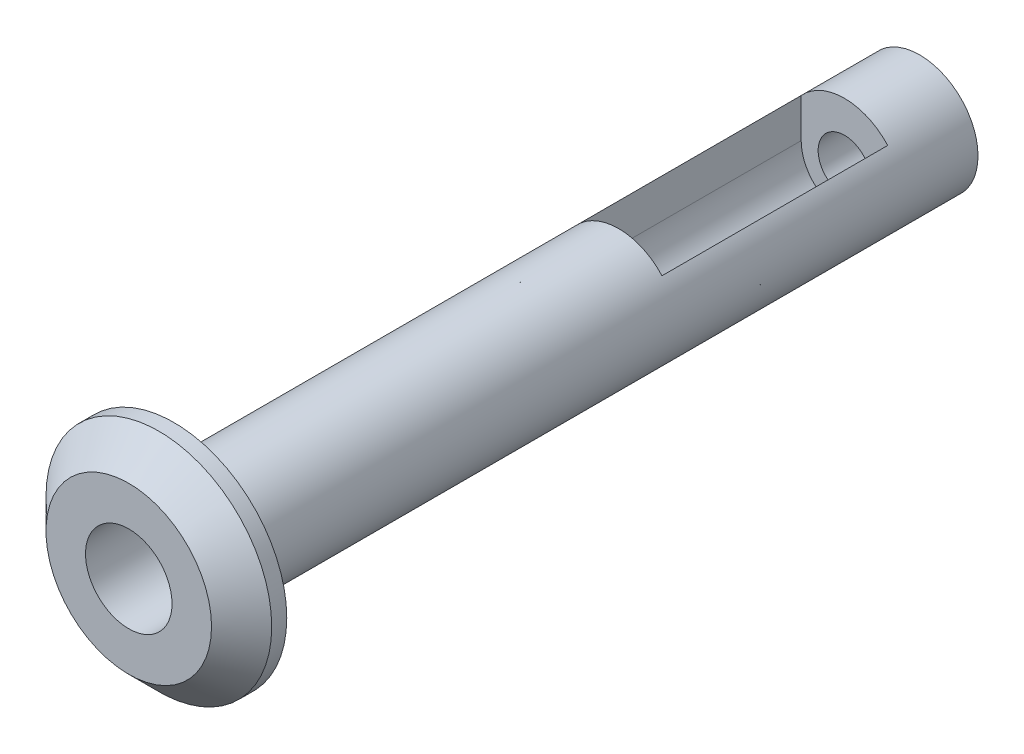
ISO-10303-21;
HEADER;
FILE_DESCRIPTION(('STEP AP214'),'2;1');
FILE_NAME('part.step','',(''),(''),'','','');
FILE_SCHEMA(('AUTOMOTIVE_DESIGN { 1 0 10303 214 1 1 1 1 }'));
ENDSEC;
DATA;
#1=APPLICATION_CONTEXT('core data for automotive mechanical design processes');
#2=APPLICATION_PROTOCOL_DEFINITION('international standard','automotive_design',2000,#1);
#3=PRODUCT_CONTEXT('',#1,'mechanical');
#4=PRODUCT('Part','Part','',(#3));
#5=PRODUCT_RELATED_PRODUCT_CATEGORY('part','',(#4));
#6=PRODUCT_DEFINITION_FORMATION('','',#4);
#7=PRODUCT_DEFINITION_CONTEXT('part definition',#1,'design');
#8=PRODUCT_DEFINITION('design','',#6,#7);
#9=PRODUCT_DEFINITION_SHAPE('','',#8);
#10=(LENGTH_UNIT() NAMED_UNIT(*) SI_UNIT(.MILLI.,.METRE.));
#11=(NAMED_UNIT(*) PLANE_ANGLE_UNIT() SI_UNIT($,.RADIAN.));
#12=(NAMED_UNIT(*) SI_UNIT($,.STERADIAN.) SOLID_ANGLE_UNIT());
#13=UNCERTAINTY_MEASURE_WITH_UNIT(LENGTH_MEASURE(1.E-05),#10,'distance_accuracy_value','');
#14=(GEOMETRIC_REPRESENTATION_CONTEXT(3) GLOBAL_UNCERTAINTY_ASSIGNED_CONTEXT((#13)) GLOBAL_UNIT_ASSIGNED_CONTEXT((#10,
#11,#12)) REPRESENTATION_CONTEXT('',''));
#15=CARTESIAN_POINT('',(0.,0.,0.));
#16=DIRECTION('',(0.,0.,1.));
#17=DIRECTION('',(1.,0.,0.));
#18=AXIS2_PLACEMENT_3D('',#15,#16,#17);
#19=CARTESIAN_POINT('',(0.,0.,-59.1917279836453));
#20=DIRECTION('',(0.,0.,1.));
#21=DIRECTION('',(1.,0.,0.));
#22=AXIS2_PLACEMENT_3D('',#19,#20,#21);
#23=CYLINDRICAL_SURFACE('',#22,2.875);
#24=CARTESIAN_POINT('',(0.,0.,1.5));
#25=DIRECTION('',(0.,0.,1.));
#26=DIRECTION('',(1.,0.,0.));
#27=AXIS2_PLACEMENT_3D('',#24,#25,#26);
#28=CIRCLE('',#27,2.875);
#29=CARTESIAN_POINT('',(2.875,0.,1.5));
#30=VERTEX_POINT('',#29);
#31=EDGE_CURVE('E97',#30,#30,#28,.T.);
#32=ORIENTED_EDGE('',*,*,#31,.T.);
#33=EDGE_LOOP('',(#32));
#34=FACE_BOUND('',#33,.T.);
#35=DIRECTION('',(0.,0.,-1.));
#36=VECTOR('',#35,1.);
#37=CARTESIAN_POINT('',(-2.875,0.,-31.06));
#38=LINE('',#37,#36);
#39=CARTESIAN_POINT('',(-2.875,0.,-31.06));
#40=VERTEX_POINT('',#39);
#41=CARTESIAN_POINT('',(-2.875,0.,-46.06));
#42=VERTEX_POINT('',#41);
#43=EDGE_CURVE('E64',#40,#42,#38,.T.);
#44=ORIENTED_EDGE('',*,*,#43,.F.);
#45=CARTESIAN_POINT('',(0.,0.,-31.06));
#46=DIRECTION('',(0.,0.,1.));
#47=DIRECTION('',(1.,0.,0.));
#48=AXIS2_PLACEMENT_3D('',#45,#46,#47);
#49=CIRCLE('',#48,2.875);
#50=CARTESIAN_POINT('',(2.875,0.,-31.06));
#51=VERTEX_POINT('',#50);
#52=EDGE_CURVE('E12',#40,#51,#49,.F.);
#53=ORIENTED_EDGE('',*,*,#52,.T.);
#54=DIRECTION('',(0.,0.,-1.));
#55=VECTOR('',#54,1.);
#56=CARTESIAN_POINT('',(2.875,0.,-31.06));
#57=LINE('',#56,#55);
#58=CARTESIAN_POINT('',(2.875,0.,-46.06));
#59=VERTEX_POINT('',#58);
#60=EDGE_CURVE('E110',#51,#59,#57,.T.);
#61=ORIENTED_EDGE('',*,*,#60,.T.);
#62=CARTESIAN_POINT('',(0.,0.,-46.06));
#63=DIRECTION('',(0.,0.,-1.));
#64=DIRECTION('',(-1.,0.,0.));
#65=AXIS2_PLACEMENT_3D('',#62,#63,#64);
#66=CIRCLE('',#65,2.875);
#67=EDGE_CURVE('E116',#42,#59,#66,.F.);
#68=ORIENTED_EDGE('',*,*,#67,.F.);
#69=EDGE_LOOP('',(#44,#53,#61,#68));
#70=FACE_BOUND('',#69,.T.);
#71=ADVANCED_FACE('F40',(#34,#70),#23,.F.);
#72=CARTESIAN_POINT('',(0.,0.,-1.5));
#73=DIRECTION('',(0.,0.,1.));
#74=DIRECTION('',(1.,0.,0.));
#75=AXIS2_PLACEMENT_3D('',#72,#73,#74);
#76=PLANE('',#75);
#77=CARTESIAN_POINT('',(0.,0.,-1.5));
#78=DIRECTION('',(0.,0.,1.));
#79=DIRECTION('',(1.,0.,0.));
#80=AXIS2_PLACEMENT_3D('',#77,#78,#79);
#81=CIRCLE('',#80,7.5);
#82=CARTESIAN_POINT('',(7.5,0.,-1.5));
#83=VERTEX_POINT('',#82);
#84=EDGE_CURVE('E126',#83,#83,#81,.T.);
#85=ORIENTED_EDGE('',*,*,#84,.F.);
#86=EDGE_LOOP('',(#85));
#87=FACE_BOUND('',#86,.T.);
#88=CARTESIAN_POINT('',(0.,0.,-1.5));
#89=DIRECTION('',(0.,0.,1.));
#90=DIRECTION('',(1.,0.,0.));
#91=AXIS2_PLACEMENT_3D('',#88,#89,#90);
#92=CIRCLE('',#91,3.875);
#93=CARTESIAN_POINT('',(3.875,0.,-1.5));
#94=VERTEX_POINT('',#93);
#95=EDGE_CURVE('E49',#94,#94,#92,.F.);
#96=ORIENTED_EDGE('',*,*,#95,.F.);
#97=EDGE_LOOP('',(#96));
#98=FACE_BOUND('',#97,.T.);
#99=ADVANCED_FACE('F161',(#87,#98),#76,.F.);
#100=CARTESIAN_POINT('',(0.,0.,1.5));
#101=DIRECTION('',(0.,0.,1.));
#102=DIRECTION('',(1.,0.,0.));
#103=AXIS2_PLACEMENT_3D('',#100,#101,#102);
#104=PLANE('',#103);
#105=ORIENTED_EDGE('',*,*,#31,.F.);
#106=EDGE_LOOP('',(#105));
#107=FACE_BOUND('',#106,.T.);
#108=CARTESIAN_POINT('',(0.,0.,1.5));
#109=DIRECTION('',(0.,0.,1.));
#110=DIRECTION('',(1.,0.,0.));
#111=AXIS2_PLACEMENT_3D('',#108,#109,#110);
#112=CIRCLE('',#111,5.5);
#113=CARTESIAN_POINT('',(5.5,0.,1.5));
#114=VERTEX_POINT('',#113);
#115=EDGE_CURVE('E129',#114,#114,#112,.T.);
#116=ORIENTED_EDGE('',*,*,#115,.T.);
#117=EDGE_LOOP('',(#116));
#118=FACE_BOUND('',#117,.T.);
#119=ADVANCED_FACE('F167',(#107,#118),#104,.T.);
#120=CARTESIAN_POINT('',(0.,0.,1.5));
#121=DIRECTION('',(0.,0.,-1.));
#122=DIRECTION('',(-1.,0.,0.));
#123=AXIS2_PLACEMENT_3D('',#120,#121,#122);
#124=CYLINDRICAL_SURFACE('',#123,7.5);
#125=CARTESIAN_POINT('',(0.,0.,-0.500000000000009));
#126=DIRECTION('',(0.,0.,1.));
#127=DIRECTION('',(1.,0.,0.));
#128=AXIS2_PLACEMENT_3D('',#125,#126,#127);
#129=CIRCLE('',#128,7.5);
#130=CARTESIAN_POINT('',(7.5,0.,-0.500000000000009));
#131=VERTEX_POINT('',#130);
#132=EDGE_CURVE('E132',#131,#131,#129,.F.);
#133=ORIENTED_EDGE('',*,*,#132,.T.);
#134=EDGE_LOOP('',(#133));
#135=FACE_BOUND('',#134,.T.);
#136=ORIENTED_EDGE('',*,*,#84,.T.);
#137=EDGE_LOOP('',(#136));
#138=FACE_BOUND('',#137,.T.);
#139=ADVANCED_FACE('F145',(#135,#138),#124,.T.);
#140=CARTESIAN_POINT('',(0.,0.,1.5));
#141=DIRECTION('',(0.,0.,-1.));
#142=DIRECTION('',(-1.,0.,0.));
#143=AXIS2_PLACEMENT_3D('',#140,#141,#142);
#144=CYLINDRICAL_SURFACE('',#143,1.75);
#145=CARTESIAN_POINT('',(0.,0.,-46.06));
#146=DIRECTION('',(0.,0.,-1.));
#147=DIRECTION('',(-1.,0.,0.));
#148=AXIS2_PLACEMENT_3D('',#145,#146,#147);
#149=CIRCLE('',#148,1.75);
#150=CARTESIAN_POINT('',(-1.75,0.,-46.06));
#151=VERTEX_POINT('',#150);
#152=EDGE_CURVE('E119',#151,#151,#149,.T.);
#153=ORIENTED_EDGE('',*,*,#152,.F.);
#154=EDGE_LOOP('',(#153));
#155=FACE_BOUND('',#154,.T.);
#156=CARTESIAN_POINT('',(0.,0.,-51.06));
#157=DIRECTION('',(0.,0.,-1.));
#158=DIRECTION('',(-1.,0.,0.));
#159=AXIS2_PLACEMENT_3D('',#156,#157,#158);
#160=CIRCLE('',#159,1.75);
#161=CARTESIAN_POINT('',(-1.75,0.,-51.06));
#162=VERTEX_POINT('',#161);
#163=EDGE_CURVE('E120',#162,#162,#160,.T.);
#164=ORIENTED_EDGE('',*,*,#163,.T.);
#165=EDGE_LOOP('',(#164));
#166=FACE_BOUND('',#165,.T.);
#167=ADVANCED_FACE('F142',(#155,#166),#144,.F.);
#168=CARTESIAN_POINT('',(0.,0.,1.5));
#169=DIRECTION('',(0.,0.,-1.));
#170=DIRECTION('',(-1.,0.,0.));
#171=AXIS2_PLACEMENT_3D('',#168,#169,#170);
#172=CONICAL_SURFACE('',#171,5.5,0.785398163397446);
#173=ORIENTED_EDGE('',*,*,#132,.F.);
#174=EDGE_LOOP('',(#173));
#175=FACE_BOUND('',#174,.T.);
#176=ORIENTED_EDGE('',*,*,#115,.F.);
#177=EDGE_LOOP('',(#176));
#178=FACE_BOUND('',#177,.T.);
#179=ADVANCED_FACE('F43',(#175,#178),#172,.T.);
#180=CARTESIAN_POINT('',(0.,0.,-51.06));
#181=DIRECTION('',(0.,0.,-1.));
#182=DIRECTION('',(-1.,0.,0.));
#183=AXIS2_PLACEMENT_3D('',#180,#181,#182);
#184=PLANE('',#183);
#185=CARTESIAN_POINT('',(0.,0.,-51.06));
#186=DIRECTION('',(0.,0.,-1.));
#187=DIRECTION('',(-1.,0.,0.));
#188=AXIS2_PLACEMENT_3D('',#185,#186,#187);
#189=CIRCLE('',#188,3.875);
#190=CARTESIAN_POINT('',(-3.875,0.,-51.06));
#191=VERTEX_POINT('',#190);
#192=EDGE_CURVE('E123',#191,#191,#189,.T.);
#193=ORIENTED_EDGE('',*,*,#192,.T.);
#194=EDGE_LOOP('',(#193));
#195=FACE_BOUND('',#194,.T.);
#196=ORIENTED_EDGE('',*,*,#163,.F.);
#197=EDGE_LOOP('',(#196));
#198=FACE_BOUND('',#197,.T.);
#199=ADVANCED_FACE('F149',(#195,#198),#184,.T.);
#200=CARTESIAN_POINT('',(0.,0.,-51.06));
#201=DIRECTION('',(0.,0.,1.));
#202=DIRECTION('',(1.,0.,0.));
#203=AXIS2_PLACEMENT_3D('',#200,#201,#202);
#204=CYLINDRICAL_SURFACE('',#203,3.875);
#205=DIRECTION('',(0.,0.,-1.));
#206=VECTOR('',#205,1.);
#207=CARTESIAN_POINT('',(2.875,2.59807621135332,-31.06));
#208=LINE('',#207,#206);
#209=CARTESIAN_POINT('',(2.875,2.59807621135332,-31.06));
#210=VERTEX_POINT('',#209);
#211=CARTESIAN_POINT('',(2.875,2.59807621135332,-46.06));
#212=VERTEX_POINT('',#211);
#213=EDGE_CURVE('E56',#210,#212,#208,.T.);
#214=ORIENTED_EDGE('',*,*,#213,.F.);
#215=CARTESIAN_POINT('',(0.,0.,-31.06));
#216=DIRECTION('',(0.,0.,1.));
#217=DIRECTION('',(1.,0.,0.));
#218=AXIS2_PLACEMENT_3D('',#215,#216,#217);
#219=CIRCLE('',#218,3.875);
#220=CARTESIAN_POINT('',(-2.875,2.59807621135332,-31.06));
#221=VERTEX_POINT('',#220);
#222=EDGE_CURVE('E87',#210,#221,#219,.T.);
#223=ORIENTED_EDGE('',*,*,#222,.T.);
#224=DIRECTION('',(0.,0.,-1.));
#225=VECTOR('',#224,1.);
#226=CARTESIAN_POINT('',(-2.875,2.59807621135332,-31.06));
#227=LINE('',#226,#225);
#228=CARTESIAN_POINT('',(-2.875,2.59807621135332,-46.06));
#229=VERTEX_POINT('',#228);
#230=EDGE_CURVE('E91',#221,#229,#227,.T.);
#231=ORIENTED_EDGE('',*,*,#230,.T.);
#232=CARTESIAN_POINT('',(0.,0.,-46.06));
#233=DIRECTION('',(0.,0.,1.));
#234=DIRECTION('',(1.,0.,0.));
#235=AXIS2_PLACEMENT_3D('',#232,#233,#234);
#236=CIRCLE('',#235,3.875);
#237=EDGE_CURVE('E106',#212,#229,#236,.T.);
#238=ORIENTED_EDGE('',*,*,#237,.F.);
#239=EDGE_LOOP('',(#214,#223,#231,#238));
#240=FACE_BOUND('',#239,.T.);
#241=ORIENTED_EDGE('',*,*,#192,.F.);
#242=EDGE_LOOP('',(#241));
#243=FACE_BOUND('',#242,.T.);
#244=ORIENTED_EDGE('',*,*,#95,.T.);
#245=EDGE_LOOP('',(#244));
#246=FACE_BOUND('',#245,.T.);
#247=ADVANCED_FACE('F99',(#240,#243,#246),#204,.T.);
#248=CARTESIAN_POINT('',(0.,0.,-46.06));
#249=DIRECTION('',(0.,0.,-1.));
#250=DIRECTION('',(-1.,0.,0.));
#251=AXIS2_PLACEMENT_3D('',#248,#249,#250);
#252=PLANE('',#251);
#253=ORIENTED_EDGE('',*,*,#152,.T.);
#254=EDGE_LOOP('',(#253));
#255=FACE_BOUND('',#254,.T.);
#256=DIRECTION('',(0.,-1.,0.));
#257=VECTOR('',#256,1.);
#258=CARTESIAN_POINT('',(-2.875,2.59807621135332,-46.06));
#259=LINE('',#258,#257);
#260=EDGE_CURVE('E93',#229,#42,#259,.T.);
#261=ORIENTED_EDGE('',*,*,#260,.T.);
#262=ORIENTED_EDGE('',*,*,#67,.T.);
#263=DIRECTION('',(0.,1.,0.));
#264=VECTOR('',#263,1.);
#265=CARTESIAN_POINT('',(2.875,0.,-46.06));
#266=LINE('',#265,#264);
#267=EDGE_CURVE('E101',#59,#212,#266,.T.);
#268=ORIENTED_EDGE('',*,*,#267,.T.);
#269=ORIENTED_EDGE('',*,*,#237,.T.);
#270=EDGE_LOOP('',(#261,#262,#268,#269));
#271=FACE_BOUND('',#270,.T.);
#272=ADVANCED_FACE('F139',(#255,#271),#252,.F.);
#273=CARTESIAN_POINT('',(0.,0.,-31.06));
#274=DIRECTION('',(0.,0.,1.));
#275=DIRECTION('',(1.,0.,0.));
#276=AXIS2_PLACEMENT_3D('',#273,#274,#275);
#277=PLANE('',#276);
#278=DIRECTION('',(0.,-1.,0.));
#279=VECTOR('',#278,1.);
#280=CARTESIAN_POINT('',(-2.875,2.59807621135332,-31.06));
#281=LINE('',#280,#279);
#282=EDGE_CURVE('E82',#221,#40,#281,.T.);
#283=ORIENTED_EDGE('',*,*,#282,.F.);
#284=ORIENTED_EDGE('',*,*,#222,.F.);
#285=DIRECTION('',(0.,1.,0.));
#286=VECTOR('',#285,1.);
#287=CARTESIAN_POINT('',(2.875,0.,-31.06));
#288=LINE('',#287,#286);
#289=EDGE_CURVE('E88',#51,#210,#288,.T.);
#290=ORIENTED_EDGE('',*,*,#289,.F.);
#291=ORIENTED_EDGE('',*,*,#52,.F.);
#292=EDGE_LOOP('',(#283,#284,#290,#291));
#293=FACE_BOUND('',#292,.T.);
#294=ADVANCED_FACE('F84',(#293),#277,.F.);
#295=CARTESIAN_POINT('',(-2.875,2.59807621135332,-31.06));
#296=DIRECTION('',(1.,0.,0.));
#297=DIRECTION('',(0.,0.,-1.));
#298=AXIS2_PLACEMENT_3D('',#295,#296,#297);
#299=PLANE('',#298);
#300=ORIENTED_EDGE('',*,*,#260,.F.);
#301=ORIENTED_EDGE('',*,*,#230,.F.);
#302=ORIENTED_EDGE('',*,*,#282,.T.);
#303=ORIENTED_EDGE('',*,*,#43,.T.);
#304=EDGE_LOOP('',(#300,#301,#302,#303));
#305=FACE_BOUND('',#304,.T.);
#306=ADVANCED_FACE('F92',(#305),#299,.T.);
#307=CARTESIAN_POINT('',(2.875,0.,-31.06));
#308=DIRECTION('',(-1.,0.,0.));
#309=DIRECTION('',(0.,0.,1.));
#310=AXIS2_PLACEMENT_3D('',#307,#308,#309);
#311=PLANE('',#310);
#312=ORIENTED_EDGE('',*,*,#267,.F.);
#313=ORIENTED_EDGE('',*,*,#60,.F.);
#314=ORIENTED_EDGE('',*,*,#289,.T.);
#315=ORIENTED_EDGE('',*,*,#213,.T.);
#316=EDGE_LOOP('',(#312,#313,#314,#315));
#317=FACE_BOUND('',#316,.T.);
#318=ADVANCED_FACE('F181',(#317),#311,.T.);
#319=CLOSED_SHELL('',(#71,#99,#119,#139,#167,#179,#199,#247,#272,#294,#306,#318));
#320=MANIFOLD_SOLID_BREP('B2',#319);
#321=ADVANCED_BREP_SHAPE_REPRESENTATION('',(#18,#320),#14);
#322=SHAPE_DEFINITION_REPRESENTATION(#9,#321);
ENDSEC;
END-ISO-10303-21;
